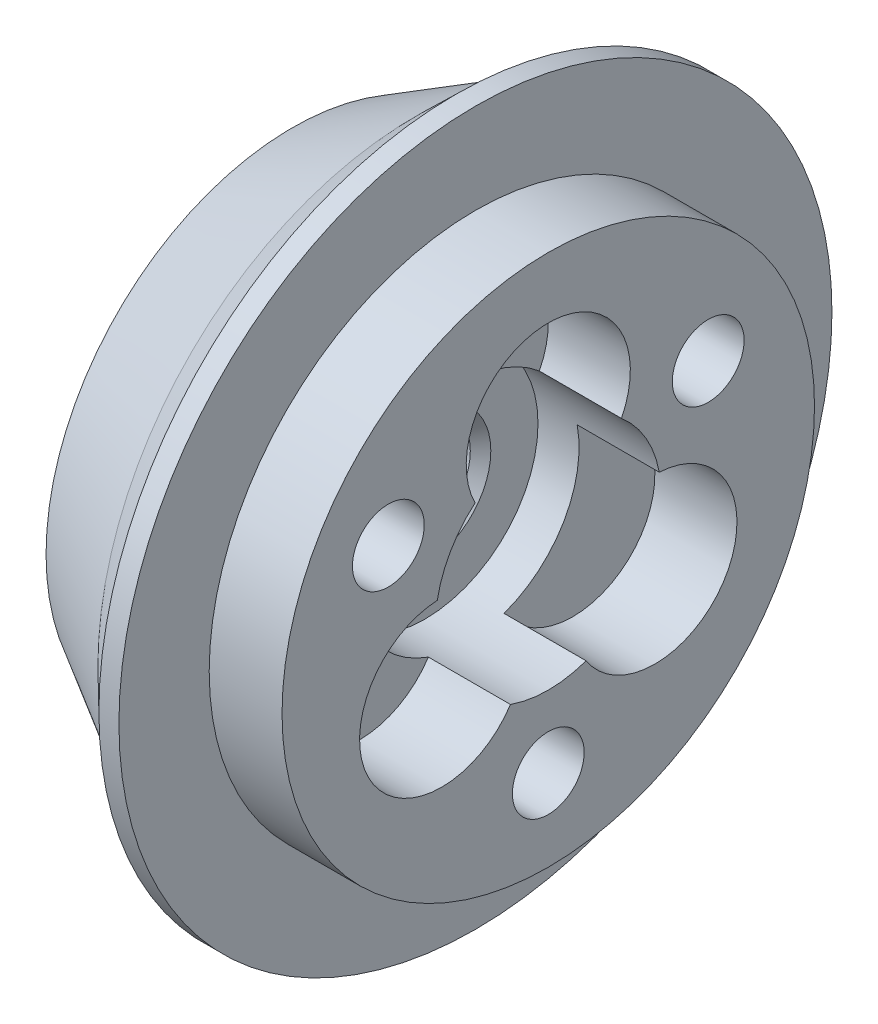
ISO-10303-21;
HEADER;
FILE_DESCRIPTION(('STEP AP214'),'2;1');
FILE_NAME('part.step','',(''),(''),'','','');
FILE_SCHEMA(('AUTOMOTIVE_DESIGN { 1 0 10303 214 1 1 1 1 }'));
ENDSEC;
DATA;
#1=APPLICATION_CONTEXT('core data for automotive mechanical design processes');
#2=APPLICATION_PROTOCOL_DEFINITION('international standard','automotive_design',2000,#1);
#3=PRODUCT_CONTEXT('',#1,'mechanical');
#4=PRODUCT('Part','Part','',(#3));
#5=PRODUCT_RELATED_PRODUCT_CATEGORY('part','',(#4));
#6=PRODUCT_DEFINITION_FORMATION('','',#4);
#7=PRODUCT_DEFINITION_CONTEXT('part definition',#1,'design');
#8=PRODUCT_DEFINITION('design','',#6,#7);
#9=PRODUCT_DEFINITION_SHAPE('','',#8);
#10=(LENGTH_UNIT() NAMED_UNIT(*) SI_UNIT(.MILLI.,.METRE.));
#11=(NAMED_UNIT(*) PLANE_ANGLE_UNIT() SI_UNIT($,.RADIAN.));
#12=(NAMED_UNIT(*) SI_UNIT($,.STERADIAN.) SOLID_ANGLE_UNIT());
#13=UNCERTAINTY_MEASURE_WITH_UNIT(LENGTH_MEASURE(1.E-05),#10,'distance_accuracy_value','');
#14=(GEOMETRIC_REPRESENTATION_CONTEXT(3) GLOBAL_UNCERTAINTY_ASSIGNED_CONTEXT((#13)) GLOBAL_UNIT_ASSIGNED_CONTEXT((#10,
#11,#12)) REPRESENTATION_CONTEXT('',''));
#15=CARTESIAN_POINT('',(0.,0.,0.));
#16=DIRECTION('',(0.,0.,1.));
#17=DIRECTION('',(1.,0.,0.));
#18=AXIS2_PLACEMENT_3D('',#15,#16,#17);
#19=CARTESIAN_POINT('',(5.9511505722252,2.01,0.));
#20=DIRECTION('',(1.,0.,0.));
#21=DIRECTION('',(0.,0.,-1.));
#22=AXIS2_PLACEMENT_3D('',#19,#20,#21);
#23=PLANE('',#22);
#24=CARTESIAN_POINT('',(5.9511505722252,0.,0.));
#25=DIRECTION('',(1.,0.,0.));
#26=DIRECTION('',(0.,0.,-1.));
#27=AXIS2_PLACEMENT_3D('',#24,#25,#26);
#28=CIRCLE('',#27,2.21);
#29=CARTESIAN_POINT('',(5.9511505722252,0.,-2.21));
#30=VERTEX_POINT('',#29);
#31=EDGE_CURVE('E293',#30,#30,#28,.F.);
#32=ORIENTED_EDGE('',*,*,#31,.T.);
#33=EDGE_LOOP('',(#32));
#34=FACE_BOUND('',#33,.T.);
#35=CARTESIAN_POINT('',(5.9511505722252,0.,0.));
#36=DIRECTION('',(1.,0.,0.));
#37=DIRECTION('',(0.,0.,-1.));
#38=AXIS2_PLACEMENT_3D('',#35,#36,#37);
#39=CIRCLE('',#38,4.5);
#40=CARTESIAN_POINT('',(5.9511505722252,3.28178047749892,3.07894736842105));
#41=VERTEX_POINT('',#40);
#42=CARTESIAN_POINT('',(5.9511505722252,-3.28178047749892,3.07894736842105));
#43=VERTEX_POINT('',#42);
#44=EDGE_CURVE('E11',#41,#43,#39,.T.);
#45=ORIENTED_EDGE('',*,*,#44,.T.);
#46=CARTESIAN_POINT('',(5.9511505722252,-6.92820323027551,6.5));
#47=DIRECTION('',(1.,0.,0.));
#48=DIRECTION('',(0.,0.,-1.));
#49=AXIS2_PLACEMENT_3D('',#46,#47,#48);
#50=CIRCLE('',#49,5.);
#51=CARTESIAN_POINT('',(5.9511505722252,-5.07028920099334,1.85800091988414));
#52=VERTEX_POINT('',#51);
#53=EDGE_CURVE('E215',#43,#52,#50,.F.);
#54=ORIENTED_EDGE('',*,*,#53,.T.);
#55=CARTESIAN_POINT('',(5.9511505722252,0.,0.));
#56=DIRECTION('',(-1.,0.,0.));
#57=DIRECTION('',(0.,0.,1.));
#58=AXIS2_PLACEMENT_3D('',#55,#56,#57);
#59=CIRCLE('',#58,5.4);
#60=CARTESIAN_POINT('',(5.9511505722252,-5.07028920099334,-1.85800091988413));
#61=VERTEX_POINT('',#60);
#62=EDGE_CURVE('E272',#61,#52,#59,.T.);
#63=ORIENTED_EDGE('',*,*,#62,.F.);
#64=CARTESIAN_POINT('',(5.9511505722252,-6.92820323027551,-6.5));
#65=DIRECTION('',(1.,0.,0.));
#66=DIRECTION('',(0.,0.,-1.));
#67=AXIS2_PLACEMENT_3D('',#64,#65,#66);
#68=CIRCLE('',#67,5.);
#69=CARTESIAN_POINT('',(5.9511505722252,-3.28178047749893,-3.07894736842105));
#70=VERTEX_POINT('',#69);
#71=EDGE_CURVE('E239',#61,#70,#68,.F.);
#72=ORIENTED_EDGE('',*,*,#71,.T.);
#73=CARTESIAN_POINT('',(5.9511505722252,0.,0.));
#74=DIRECTION('',(1.,0.,0.));
#75=DIRECTION('',(0.,0.,-1.));
#76=AXIS2_PLACEMENT_3D('',#73,#74,#75);
#77=CIRCLE('',#76,4.5);
#78=CARTESIAN_POINT('',(5.9511505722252,3.28178047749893,-3.07894736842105));
#79=VERTEX_POINT('',#78);
#80=EDGE_CURVE('E344',#70,#79,#77,.T.);
#81=ORIENTED_EDGE('',*,*,#80,.T.);
#82=CARTESIAN_POINT('',(5.9511505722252,6.92820323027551,-6.5));
#83=DIRECTION('',(1.,0.,0.));
#84=DIRECTION('',(0.,0.,-1.));
#85=AXIS2_PLACEMENT_3D('',#82,#83,#84);
#86=CIRCLE('',#85,5.);
#87=CARTESIAN_POINT('',(5.9511505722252,5.07028920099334,-1.85800091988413));
#88=VERTEX_POINT('',#87);
#89=EDGE_CURVE('E248',#88,#79,#86,.T.);
#90=ORIENTED_EDGE('',*,*,#89,.F.);
#91=CARTESIAN_POINT('',(5.9511505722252,5.07028920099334,1.85800091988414));
#92=VERTEX_POINT('',#91);
#93=EDGE_CURVE('E271',#92,#88,#59,.T.);
#94=ORIENTED_EDGE('',*,*,#93,.F.);
#95=CARTESIAN_POINT('',(5.9511505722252,6.92820323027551,6.5));
#96=DIRECTION('',(1.,0.,0.));
#97=DIRECTION('',(0.,0.,-1.));
#98=AXIS2_PLACEMENT_3D('',#95,#96,#97);
#99=CIRCLE('',#98,5.);
#100=EDGE_CURVE('E208',#41,#92,#99,.T.);
#101=ORIENTED_EDGE('',*,*,#100,.F.);
#102=EDGE_LOOP('',(#45,#54,#63,#72,#81,#90,#94,#101));
#103=FACE_BOUND('',#102,.T.);
#104=ADVANCED_FACE('F30',(#34,#103),#23,.T.);
#105=CARTESIAN_POINT('',(0.,0.,0.));
#106=DIRECTION('',(-1.,0.,0.));
#107=DIRECTION('',(0.,0.,1.));
#108=AXIS2_PLACEMENT_3D('',#105,#106,#107);
#109=CYLINDRICAL_SURFACE('',#108,5.4);
#110=CARTESIAN_POINT('',(11.9511505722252,0.,0.));
#111=DIRECTION('',(1.,0.,0.));
#112=DIRECTION('',(0.,0.,-1.));
#113=AXIS2_PLACEMENT_3D('',#110,#111,#112);
#114=CIRCLE('',#113,5.4);
#115=CARTESIAN_POINT('',(11.9511505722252,0.,-5.4));
#116=VERTEX_POINT('',#115);
#117=EDGE_CURVE('E308',#116,#116,#114,.T.);
#118=ORIENTED_EDGE('',*,*,#117,.T.);
#119=EDGE_LOOP('',(#118));
#120=FACE_BOUND('',#119,.T.);
#121=ORIENTED_EDGE('',*,*,#62,.T.);
#122=DIRECTION('',(-1.,0.,0.));
#123=VECTOR('',#122,1.);
#124=CARTESIAN_POINT('',(7.9755752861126,-5.07028920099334,1.85800091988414));
#125=LINE('',#124,#123);
#126=CARTESIAN_POINT('',(10.,-5.07028920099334,1.85800091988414));
#127=VERTEX_POINT('',#126);
#128=EDGE_CURVE('E38',#52,#127,#125,.F.);
#129=ORIENTED_EDGE('',*,*,#128,.T.);
#130=CARTESIAN_POINT('',(10.,0.,0.));
#131=DIRECTION('',(-1.,0.,0.));
#132=DIRECTION('',(0.,0.,1.));
#133=AXIS2_PLACEMENT_3D('',#130,#131,#132);
#134=CIRCLE('',#133,5.4);
#135=CARTESIAN_POINT('',(10.,5.07028920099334,1.85800091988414));
#136=VERTEX_POINT('',#135);
#137=EDGE_CURVE('E347',#127,#136,#134,.T.);
#138=ORIENTED_EDGE('',*,*,#137,.T.);
#139=DIRECTION('',(-1.,0.,0.));
#140=VECTOR('',#139,1.);
#141=CARTESIAN_POINT('',(7.9755752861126,5.07028920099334,1.85800091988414));
#142=LINE('',#141,#140);
#143=EDGE_CURVE('E350',#92,#136,#142,.F.);
#144=ORIENTED_EDGE('',*,*,#143,.F.);
#145=ORIENTED_EDGE('',*,*,#93,.T.);
#146=DIRECTION('',(-1.,0.,0.));
#147=VECTOR('',#146,1.);
#148=CARTESIAN_POINT('',(5.,5.07028920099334,-1.85800091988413));
#149=LINE('',#148,#147);
#150=CARTESIAN_POINT('',(10.,5.07028920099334,-1.85800091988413));
#151=VERTEX_POINT('',#150);
#152=EDGE_CURVE('E341',#151,#88,#149,.T.);
#153=ORIENTED_EDGE('',*,*,#152,.F.);
#154=CARTESIAN_POINT('',(10.,0.,0.));
#155=DIRECTION('',(-1.,0.,0.));
#156=DIRECTION('',(0.,0.,1.));
#157=AXIS2_PLACEMENT_3D('',#154,#155,#156);
#158=CIRCLE('',#157,5.4);
#159=CARTESIAN_POINT('',(10.,-5.07028920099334,-1.85800091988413));
#160=VERTEX_POINT('',#159);
#161=EDGE_CURVE('E335',#151,#160,#158,.T.);
#162=ORIENTED_EDGE('',*,*,#161,.T.);
#163=DIRECTION('',(-1.,0.,0.));
#164=VECTOR('',#163,1.);
#165=CARTESIAN_POINT('',(7.9755752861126,-5.07028920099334,-1.85800091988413));
#166=LINE('',#165,#164);
#167=EDGE_CURVE('E338',#160,#61,#166,.T.);
#168=ORIENTED_EDGE('',*,*,#167,.T.);
#169=EDGE_LOOP('',(#121,#129,#138,#144,#145,#153,#162,#168));
#170=FACE_BOUND('',#169,.T.);
#171=ADVANCED_FACE('F353',(#120,#170),#109,.F.);
#172=CARTESIAN_POINT('',(0.,0.,0.));
#173=DIRECTION('',(1.,0.,0.));
#174=DIRECTION('',(0.,0.,-1.));
#175=AXIS2_PLACEMENT_3D('',#172,#173,#174);
#176=PLANE('',#175);
#177=CARTESIAN_POINT('',(0.,6.92820323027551,6.5));
#178=DIRECTION('',(-1.,0.,0.));
#179=DIRECTION('',(0.,0.,1.));
#180=AXIS2_PLACEMENT_3D('',#177,#178,#179);
#181=CIRCLE('',#180,5.);
#182=CARTESIAN_POINT('',(0.,10.5746259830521,9.92105263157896));
#183=VERTEX_POINT('',#182);
#184=CARTESIAN_POINT('',(0.,3.28178047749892,3.07894736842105));
#185=VERTEX_POINT('',#184);
#186=EDGE_CURVE('E198',#183,#185,#181,.T.);
#187=ORIENTED_EDGE('',*,*,#186,.F.);
#188=CARTESIAN_POINT('',(0.,0.,0.));
#189=DIRECTION('',(-1.,0.,0.));
#190=DIRECTION('',(0.,0.,1.));
#191=AXIS2_PLACEMENT_3D('',#188,#189,#190);
#192=CIRCLE('',#191,14.5);
#193=CARTESIAN_POINT('',(0.,-10.5746259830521,9.92105263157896));
#194=VERTEX_POINT('',#193);
#195=EDGE_CURVE('E45',#194,#183,#192,.T.);
#196=ORIENTED_EDGE('',*,*,#195,.F.);
#197=CARTESIAN_POINT('',(0.,-6.92820323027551,6.5));
#198=DIRECTION('',(-1.,0.,0.));
#199=DIRECTION('',(0.,0.,1.));
#200=AXIS2_PLACEMENT_3D('',#197,#198,#199);
#201=CIRCLE('',#200,5.);
#202=CARTESIAN_POINT('',(0.,-3.28178047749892,3.07894736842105));
#203=VERTEX_POINT('',#202);
#204=EDGE_CURVE('E191',#194,#203,#201,.F.);
#205=ORIENTED_EDGE('',*,*,#204,.T.);
#206=CARTESIAN_POINT('',(0.,0.,0.));
#207=DIRECTION('',(-1.,0.,0.));
#208=DIRECTION('',(0.,0.,1.));
#209=AXIS2_PLACEMENT_3D('',#206,#207,#208);
#210=CIRCLE('',#209,4.5);
#211=EDGE_CURVE('E201',#203,#185,#210,.T.);
#212=ORIENTED_EDGE('',*,*,#211,.T.);
#213=EDGE_LOOP('',(#187,#196,#205,#212));
#214=FACE_BOUND('',#213,.T.);
#215=CARTESIAN_POINT('',(0.,0.,0.));
#216=DIRECTION('',(-1.,0.,0.));
#217=DIRECTION('',(0.,0.,1.));
#218=AXIS2_PLACEMENT_3D('',#215,#216,#217);
#219=CIRCLE('',#218,14.5);
#220=CARTESIAN_POINT('',(0.,10.5746259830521,-9.92105263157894));
#221=VERTEX_POINT('',#220);
#222=CARTESIAN_POINT('',(0.,-10.5746259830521,-9.92105263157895));
#223=VERTEX_POINT('',#222);
#224=EDGE_CURVE('E229',#221,#223,#219,.T.);
#225=ORIENTED_EDGE('',*,*,#224,.F.);
#226=CARTESIAN_POINT('',(0.,6.92820323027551,-6.5));
#227=DIRECTION('',(-1.,0.,0.));
#228=DIRECTION('',(0.,0.,1.));
#229=AXIS2_PLACEMENT_3D('',#226,#227,#228);
#230=CIRCLE('',#229,5.);
#231=CARTESIAN_POINT('',(0.,3.28178047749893,-3.07894736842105));
#232=VERTEX_POINT('',#231);
#233=EDGE_CURVE('E218',#232,#221,#230,.T.);
#234=ORIENTED_EDGE('',*,*,#233,.F.);
#235=CARTESIAN_POINT('',(0.,0.,0.));
#236=DIRECTION('',(-1.,0.,0.));
#237=DIRECTION('',(0.,0.,1.));
#238=AXIS2_PLACEMENT_3D('',#235,#236,#237);
#239=CIRCLE('',#238,4.5);
#240=CARTESIAN_POINT('',(0.,-3.28178047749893,-3.07894736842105));
#241=VERTEX_POINT('',#240);
#242=EDGE_CURVE('E222',#232,#241,#239,.T.);
#243=ORIENTED_EDGE('',*,*,#242,.T.);
#244=CARTESIAN_POINT('',(0.,-6.92820323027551,-6.5));
#245=DIRECTION('',(-1.,0.,0.));
#246=DIRECTION('',(0.,0.,1.));
#247=AXIS2_PLACEMENT_3D('',#244,#245,#246);
#248=CIRCLE('',#247,5.);
#249=EDGE_CURVE('E232',#241,#223,#248,.F.);
#250=ORIENTED_EDGE('',*,*,#249,.T.);
#251=EDGE_LOOP('',(#225,#234,#243,#250));
#252=FACE_BOUND('',#251,.T.);
#253=CARTESIAN_POINT('',(0.,0.,0.));
#254=DIRECTION('',(1.,0.,0.));
#255=DIRECTION('',(0.,0.,-1.));
#256=AXIS2_PLACEMENT_3D('',#253,#254,#255);
#257=CIRCLE('',#256,2.21000000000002);
#258=CARTESIAN_POINT('',(0.,0.,-2.21000000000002));
#259=VERTEX_POINT('',#258);
#260=EDGE_CURVE('E302',#259,#259,#257,.T.);
#261=ORIENTED_EDGE('',*,*,#260,.T.);
#262=EDGE_LOOP('',(#261));
#263=FACE_BOUND('',#262,.T.);
#264=CARTESIAN_POINT('',(0.,0.,0.));
#265=DIRECTION('',(-1.,0.,0.));
#266=DIRECTION('',(0.,0.,1.));
#267=AXIS2_PLACEMENT_3D('',#264,#265,#266);
#268=CIRCLE('',#267,24.);
#269=CARTESIAN_POINT('',(0.,0.,24.));
#270=VERTEX_POINT('',#269);
#271=EDGE_CURVE('E290',#270,#270,#268,.T.);
#272=ORIENTED_EDGE('',*,*,#271,.T.);
#273=EDGE_LOOP('',(#272));
#274=FACE_BOUND('',#273,.T.);
#275=ADVANCED_FACE('F371',(#214,#252,#263,#274),#176,.F.);
#276=CARTESIAN_POINT('',(24.9511505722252,25.95,0.));
#277=DIRECTION('',(-1.,0.,0.));
#278=DIRECTION('',(0.,0.,1.));
#279=AXIS2_PLACEMENT_3D('',#276,#277,#278);
#280=PLANE('',#279);
#281=CARTESIAN_POINT('',(24.9511505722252,9.00000000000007,15.5884572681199));
#282=DIRECTION('',(1.,0.,0.));
#283=DIRECTION('',(0.,0.,-1.));
#284=AXIS2_PLACEMENT_3D('',#281,#282,#283);
#285=CIRCLE('',#284,3.5);
#286=CARTESIAN_POINT('',(24.9511505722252,9.00000000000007,12.0884572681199));
#287=VERTEX_POINT('',#286);
#288=EDGE_CURVE('E172',#287,#287,#285,.T.);
#289=ORIENTED_EDGE('',*,*,#288,.F.);
#290=EDGE_LOOP('',(#289));
#291=FACE_BOUND('',#290,.T.);
#292=CARTESIAN_POINT('',(24.9511505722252,9.00000000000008,-15.5884572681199));
#293=DIRECTION('',(1.,0.,0.));
#294=DIRECTION('',(0.,0.,-1.));
#295=AXIS2_PLACEMENT_3D('',#292,#293,#294);
#296=CIRCLE('',#295,3.5);
#297=CARTESIAN_POINT('',(24.9511505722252,9.00000000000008,-19.0884572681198));
#298=VERTEX_POINT('',#297);
#299=EDGE_CURVE('E180',#298,#298,#296,.T.);
#300=ORIENTED_EDGE('',*,*,#299,.F.);
#301=EDGE_LOOP('',(#300));
#302=FACE_BOUND('',#301,.T.);
#303=CARTESIAN_POINT('',(24.9511505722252,-18.,0.));
#304=DIRECTION('',(1.,0.,0.));
#305=DIRECTION('',(0.,0.,-1.));
#306=AXIS2_PLACEMENT_3D('',#303,#304,#305);
#307=CIRCLE('',#306,3.5);
#308=CARTESIAN_POINT('',(24.9511505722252,-18.,-3.5));
#309=VERTEX_POINT('',#308);
#310=EDGE_CURVE('E186',#309,#309,#307,.T.);
#311=ORIENTED_EDGE('',*,*,#310,.F.);
#312=EDGE_LOOP('',(#311));
#313=FACE_BOUND('',#312,.T.);
#314=CARTESIAN_POINT('',(24.9511505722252,0.,0.));
#315=DIRECTION('',(-1.,0.,0.));
#316=DIRECTION('',(0.,0.,1.));
#317=AXIS2_PLACEMENT_3D('',#314,#315,#316);
#318=CIRCLE('',#317,25.95);
#319=CARTESIAN_POINT('',(24.9511505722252,0.,25.95));
#320=VERTEX_POINT('',#319);
#321=EDGE_CURVE('E275',#320,#320,#318,.T.);
#322=ORIENTED_EDGE('',*,*,#321,.F.);
#323=EDGE_LOOP('',(#322));
#324=FACE_BOUND('',#323,.T.);
#325=CARTESIAN_POINT('',(24.9511505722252,0.,0.));
#326=DIRECTION('',(-1.,0.,0.));
#327=DIRECTION('',(0.,0.,1.));
#328=AXIS2_PLACEMENT_3D('',#325,#326,#327);
#329=CIRCLE('',#328,11.);
#330=CARTESIAN_POINT('',(24.9511505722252,-10.3636259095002,-3.68717480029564));
#331=VERTEX_POINT('',#330);
#332=CARTESIAN_POINT('',(24.9511505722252,-10.3636259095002,3.68717480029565));
#333=VERTEX_POINT('',#332);
#334=EDGE_CURVE('E268',#331,#333,#329,.T.);
#335=ORIENTED_EDGE('',*,*,#334,.T.);
#336=CARTESIAN_POINT('',(24.9511505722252,-6.00000000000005,10.3923048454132));
#337=DIRECTION('',(1.,0.,0.));
#338=DIRECTION('',(0.,0.,-1.));
#339=AXIS2_PLACEMENT_3D('',#336,#337,#338);
#340=CIRCLE('',#339,8.);
#341=CARTESIAN_POINT('',(24.9511505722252,1.98862590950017,10.8187507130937));
#342=VERTEX_POINT('',#341);
#343=EDGE_CURVE('E250',#342,#333,#340,.T.);
#344=ORIENTED_EDGE('',*,*,#343,.F.);
#345=CARTESIAN_POINT('',(24.9511505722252,8.375,7.13157591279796));
#346=VERTEX_POINT('',#345);
#347=EDGE_CURVE('E261',#342,#346,#329,.T.);
#348=ORIENTED_EDGE('',*,*,#347,.T.);
#349=CARTESIAN_POINT('',(24.9511505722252,12.,0.));
#350=DIRECTION('',(1.,0.,0.));
#351=DIRECTION('',(0.,0.,-1.));
#352=AXIS2_PLACEMENT_3D('',#349,#350,#351);
#353=CIRCLE('',#352,8.);
#354=CARTESIAN_POINT('',(24.9511505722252,8.375,-7.13157591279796));
#355=VERTEX_POINT('',#354);
#356=EDGE_CURVE('E257',#355,#346,#353,.T.);
#357=ORIENTED_EDGE('',*,*,#356,.F.);
#358=CARTESIAN_POINT('',(24.9511505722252,1.98862590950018,-10.8187507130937));
#359=VERTEX_POINT('',#358);
#360=EDGE_CURVE('E264',#355,#359,#329,.T.);
#361=ORIENTED_EDGE('',*,*,#360,.T.);
#362=CARTESIAN_POINT('',(24.9511505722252,-6.00000000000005,-10.3923048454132));
#363=DIRECTION('',(1.,0.,0.));
#364=DIRECTION('',(0.,0.,-1.));
#365=AXIS2_PLACEMENT_3D('',#362,#363,#364);
#366=CIRCLE('',#365,8.00000000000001);
#367=EDGE_CURVE('E253',#331,#359,#366,.T.);
#368=ORIENTED_EDGE('',*,*,#367,.F.);
#369=EDGE_LOOP('',(#335,#344,#348,#357,#361,#368));
#370=FACE_BOUND('',#369,.T.);
#371=ADVANCED_FACE('F425',(#291,#302,#313,#324,#370),#280,.F.);
#372=CARTESIAN_POINT('',(11.9511505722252,0.,0.));
#373=DIRECTION('',(1.,0.,0.));
#374=DIRECTION('',(0.,0.,-1.));
#375=AXIS2_PLACEMENT_3D('',#372,#373,#374);
#376=CONICAL_SURFACE('',#375,30.9,0.5235987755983);
#377=ORIENTED_EDGE('',*,*,#271,.F.);
#378=EDGE_LOOP('',(#377));
#379=FACE_BOUND('',#378,.T.);
#380=CARTESIAN_POINT('',(11.9511505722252,0.,0.));
#381=DIRECTION('',(-1.,0.,0.));
#382=DIRECTION('',(0.,0.,1.));
#383=AXIS2_PLACEMENT_3D('',#380,#381,#382);
#384=CIRCLE('',#383,30.9);
#385=CARTESIAN_POINT('',(11.9511505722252,0.,30.9));
#386=VERTEX_POINT('',#385);
#387=EDGE_CURVE('E287',#386,#386,#384,.T.);
#388=ORIENTED_EDGE('',*,*,#387,.T.);
#389=EDGE_LOOP('',(#388));
#390=FACE_BOUND('',#389,.T.);
#391=ADVANCED_FACE('F428',(#379,#390),#376,.T.);
#392=CARTESIAN_POINT('',(15.9,0.,0.));
#393=DIRECTION('',(1.,0.,0.));
#394=DIRECTION('',(0.,0.,-1.));
#395=AXIS2_PLACEMENT_3D('',#392,#393,#394);
#396=CONICAL_SURFACE('',#395,34.75,0.772723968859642);
#397=ORIENTED_EDGE('',*,*,#387,.F.);
#398=EDGE_LOOP('',(#397));
#399=FACE_BOUND('',#398,.T.);
#400=CARTESIAN_POINT('',(15.9,0.,0.));
#401=DIRECTION('',(-1.,0.,0.));
#402=DIRECTION('',(0.,0.,1.));
#403=AXIS2_PLACEMENT_3D('',#400,#401,#402);
#404=CIRCLE('',#403,34.75);
#405=CARTESIAN_POINT('',(15.9,0.,34.75));
#406=VERTEX_POINT('',#405);
#407=EDGE_CURVE('E284',#406,#406,#404,.T.);
#408=ORIENTED_EDGE('',*,*,#407,.T.);
#409=EDGE_LOOP('',(#408));
#410=FACE_BOUND('',#409,.T.);
#411=ADVANCED_FACE('F440',(#399,#410),#396,.T.);
#412=CARTESIAN_POINT('',(0.,0.,0.));
#413=DIRECTION('',(-1.,0.,0.));
#414=DIRECTION('',(0.,0.,1.));
#415=AXIS2_PLACEMENT_3D('',#412,#413,#414);
#416=CYLINDRICAL_SURFACE('',#415,34.75);
#417=ORIENTED_EDGE('',*,*,#407,.F.);
#418=EDGE_LOOP('',(#417));
#419=FACE_BOUND('',#418,.T.);
#420=CARTESIAN_POINT('',(17.8511505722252,0.,0.));
#421=DIRECTION('',(-1.,0.,0.));
#422=DIRECTION('',(0.,0.,1.));
#423=AXIS2_PLACEMENT_3D('',#420,#421,#422);
#424=CIRCLE('',#423,34.75);
#425=CARTESIAN_POINT('',(17.8511505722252,0.,34.75));
#426=VERTEX_POINT('',#425);
#427=EDGE_CURVE('E281',#426,#426,#424,.T.);
#428=ORIENTED_EDGE('',*,*,#427,.T.);
#429=EDGE_LOOP('',(#428));
#430=FACE_BOUND('',#429,.T.);
#431=ADVANCED_FACE('F436',(#419,#430),#416,.T.);
#432=CARTESIAN_POINT('',(17.8511505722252,34.75,0.));
#433=DIRECTION('',(-1.,0.,0.));
#434=DIRECTION('',(0.,0.,1.));
#435=AXIS2_PLACEMENT_3D('',#432,#433,#434);
#436=PLANE('',#435);
#437=ORIENTED_EDGE('',*,*,#427,.F.);
#438=EDGE_LOOP('',(#437));
#439=FACE_BOUND('',#438,.T.);
#440=CARTESIAN_POINT('',(17.8511505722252,0.,0.));
#441=DIRECTION('',(-1.,0.,0.));
#442=DIRECTION('',(0.,0.,1.));
#443=AXIS2_PLACEMENT_3D('',#440,#441,#442);
#444=CIRCLE('',#443,25.95);
#445=CARTESIAN_POINT('',(17.8511505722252,0.,25.95));
#446=VERTEX_POINT('',#445);
#447=EDGE_CURVE('E278',#446,#446,#444,.T.);
#448=ORIENTED_EDGE('',*,*,#447,.T.);
#449=EDGE_LOOP('',(#448));
#450=FACE_BOUND('',#449,.T.);
#451=ADVANCED_FACE('F432',(#439,#450),#436,.F.);
#452=CARTESIAN_POINT('',(0.,0.,0.));
#453=DIRECTION('',(-1.,0.,0.));
#454=DIRECTION('',(0.,0.,1.));
#455=AXIS2_PLACEMENT_3D('',#452,#453,#454);
#456=CYLINDRICAL_SURFACE('',#455,25.95);
#457=ORIENTED_EDGE('',*,*,#447,.F.);
#458=EDGE_LOOP('',(#457));
#459=FACE_BOUND('',#458,.T.);
#460=ORIENTED_EDGE('',*,*,#321,.T.);
#461=EDGE_LOOP('',(#460));
#462=FACE_BOUND('',#461,.T.);
#463=ADVANCED_FACE('F423',(#459,#462),#456,.T.);
#464=CARTESIAN_POINT('',(0.,0.,0.));
#465=DIRECTION('',(-1.,0.,0.));
#466=DIRECTION('',(0.,0.,1.));
#467=AXIS2_PLACEMENT_3D('',#464,#465,#466);
#468=CYLINDRICAL_SURFACE('',#467,2.01);
#469=CARTESIAN_POINT('',(5.75115057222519,0.,0.));
#470=DIRECTION('',(1.,0.,0.));
#471=DIRECTION('',(0.,0.,-1.));
#472=AXIS2_PLACEMENT_3D('',#469,#470,#471);
#473=CIRCLE('',#472,2.01);
#474=CARTESIAN_POINT('',(5.75115057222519,0.,-2.01));
#475=VERTEX_POINT('',#474);
#476=EDGE_CURVE('E299',#475,#475,#473,.T.);
#477=ORIENTED_EDGE('',*,*,#476,.T.);
#478=EDGE_LOOP('',(#477));
#479=FACE_BOUND('',#478,.T.);
#480=CARTESIAN_POINT('',(0.200000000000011,0.,0.));
#481=DIRECTION('',(1.,0.,0.));
#482=DIRECTION('',(0.,0.,-1.));
#483=AXIS2_PLACEMENT_3D('',#480,#481,#482);
#484=CIRCLE('',#483,2.01);
#485=CARTESIAN_POINT('',(0.200000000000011,0.,-2.01));
#486=VERTEX_POINT('',#485);
#487=EDGE_CURVE('E296',#486,#486,#484,.F.);
#488=ORIENTED_EDGE('',*,*,#487,.T.);
#489=EDGE_LOOP('',(#488));
#490=FACE_BOUND('',#489,.T.);
#491=ADVANCED_FACE('F419',(#479,#490),#468,.F.);
#492=CARTESIAN_POINT('',(12.9511505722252,5.4,0.));
#493=DIRECTION('',(1.,0.,0.));
#494=DIRECTION('',(0.,0.,-1.));
#495=AXIS2_PLACEMENT_3D('',#492,#493,#494);
#496=PLANE('',#495);
#497=CARTESIAN_POINT('',(12.9511505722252,0.,0.));
#498=DIRECTION('',(1.,0.,0.));
#499=DIRECTION('',(0.,0.,-1.));
#500=AXIS2_PLACEMENT_3D('',#497,#498,#499);
#501=CIRCLE('',#500,6.4);
#502=CARTESIAN_POINT('',(12.9511505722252,0.,-6.4));
#503=VERTEX_POINT('',#502);
#504=EDGE_CURVE('E305',#503,#503,#501,.F.);
#505=ORIENTED_EDGE('',*,*,#504,.T.);
#506=EDGE_LOOP('',(#505));
#507=FACE_BOUND('',#506,.T.);
#508=CARTESIAN_POINT('',(12.9511505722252,0.,0.));
#509=DIRECTION('',(-1.,0.,0.));
#510=DIRECTION('',(0.,0.,1.));
#511=AXIS2_PLACEMENT_3D('',#508,#509,#510);
#512=CIRCLE('',#511,11.);
#513=CARTESIAN_POINT('',(12.9511505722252,0.,11.));
#514=VERTEX_POINT('',#513);
#515=EDGE_CURVE('E267',#514,#514,#512,.T.);
#516=ORIENTED_EDGE('',*,*,#515,.F.);
#517=EDGE_LOOP('',(#516));
#518=FACE_BOUND('',#517,.T.);
#519=ADVANCED_FACE('F422',(#507,#518),#496,.T.);
#520=CARTESIAN_POINT('',(0.,0.,0.));
#521=DIRECTION('',(-1.,0.,0.));
#522=DIRECTION('',(0.,0.,1.));
#523=AXIS2_PLACEMENT_3D('',#520,#521,#522);
#524=CYLINDRICAL_SURFACE('',#523,11.);
#525=DIRECTION('',(1.,0.,0.));
#526=VECTOR('',#525,1.);
#527=CARTESIAN_POINT('',(20.9511505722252,1.98862590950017,10.8187507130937));
#528=LINE('',#527,#526);
#529=CARTESIAN_POINT('',(16.9511505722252,1.98862590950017,10.8187507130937));
#530=VERTEX_POINT('',#529);
#531=EDGE_CURVE('E333',#530,#342,#528,.T.);
#532=ORIENTED_EDGE('',*,*,#531,.F.);
#533=CARTESIAN_POINT('',(16.9511505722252,0.,0.));
#534=DIRECTION('',(1.,0.,0.));
#535=DIRECTION('',(0.,0.,-1.));
#536=AXIS2_PLACEMENT_3D('',#533,#534,#535);
#537=CIRCLE('',#536,11.);
#538=CARTESIAN_POINT('',(16.9511505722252,-10.3636259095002,3.68717480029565));
#539=VERTEX_POINT('',#538);
#540=EDGE_CURVE('E327',#530,#539,#537,.T.);
#541=ORIENTED_EDGE('',*,*,#540,.T.);
#542=DIRECTION('',(1.,0.,0.));
#543=VECTOR('',#542,1.);
#544=CARTESIAN_POINT('',(20.9511505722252,-10.3636259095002,3.68717480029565));
#545=LINE('',#544,#543);
#546=EDGE_CURVE('E330',#333,#539,#545,.F.);
#547=ORIENTED_EDGE('',*,*,#546,.F.);
#548=ORIENTED_EDGE('',*,*,#334,.F.);
#549=DIRECTION('',(1.,0.,0.));
#550=VECTOR('',#549,1.);
#551=CARTESIAN_POINT('',(20.9511505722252,-10.3636259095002,-3.68717480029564));
#552=LINE('',#551,#550);
#553=CARTESIAN_POINT('',(16.9511505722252,-10.3636259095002,-3.68717480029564));
#554=VERTEX_POINT('',#553);
#555=EDGE_CURVE('E325',#554,#331,#552,.T.);
#556=ORIENTED_EDGE('',*,*,#555,.F.);
#557=CARTESIAN_POINT('',(16.9511505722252,0.,0.));
#558=DIRECTION('',(1.,0.,0.));
#559=DIRECTION('',(0.,0.,-1.));
#560=AXIS2_PLACEMENT_3D('',#557,#558,#559);
#561=CIRCLE('',#560,11.);
#562=CARTESIAN_POINT('',(16.9511505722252,1.98862590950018,-10.8187507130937));
#563=VERTEX_POINT('',#562);
#564=EDGE_CURVE('E319',#554,#563,#561,.T.);
#565=ORIENTED_EDGE('',*,*,#564,.T.);
#566=DIRECTION('',(1.,0.,0.));
#567=VECTOR('',#566,1.);
#568=CARTESIAN_POINT('',(20.9511505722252,1.98862590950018,-10.8187507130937));
#569=LINE('',#568,#567);
#570=EDGE_CURVE('E322',#359,#563,#569,.F.);
#571=ORIENTED_EDGE('',*,*,#570,.F.);
#572=ORIENTED_EDGE('',*,*,#360,.F.);
#573=DIRECTION('',(1.,0.,0.));
#574=VECTOR('',#573,1.);
#575=CARTESIAN_POINT('',(20.9511505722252,8.375,-7.13157591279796));
#576=LINE('',#575,#574);
#577=CARTESIAN_POINT('',(16.9511505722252,8.375,-7.13157591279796));
#578=VERTEX_POINT('',#577);
#579=EDGE_CURVE('E317',#578,#355,#576,.T.);
#580=ORIENTED_EDGE('',*,*,#579,.F.);
#581=CARTESIAN_POINT('',(16.9511505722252,0.,0.));
#582=DIRECTION('',(1.,0.,0.));
#583=DIRECTION('',(0.,0.,-1.));
#584=AXIS2_PLACEMENT_3D('',#581,#582,#583);
#585=CIRCLE('',#584,11.);
#586=CARTESIAN_POINT('',(16.9511505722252,8.375,7.13157591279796));
#587=VERTEX_POINT('',#586);
#588=EDGE_CURVE('E311',#578,#587,#585,.T.);
#589=ORIENTED_EDGE('',*,*,#588,.T.);
#590=DIRECTION('',(1.,0.,0.));
#591=VECTOR('',#590,1.);
#592=CARTESIAN_POINT('',(20.9511505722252,8.375,7.13157591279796));
#593=LINE('',#592,#591);
#594=EDGE_CURVE('E314',#346,#587,#593,.F.);
#595=ORIENTED_EDGE('',*,*,#594,.F.);
#596=ORIENTED_EDGE('',*,*,#347,.F.);
#597=EDGE_LOOP('',(#532,#541,#547,#548,#556,#565,#571,#572,#580,#589,#595,#596));
#598=FACE_BOUND('',#597,.T.);
#599=ORIENTED_EDGE('',*,*,#515,.T.);
#600=EDGE_LOOP('',(#599));
#601=FACE_BOUND('',#600,.T.);
#602=ADVANCED_FACE('F453',(#598,#601),#524,.F.);
#603=CARTESIAN_POINT('',(5.9511505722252,0.,0.));
#604=DIRECTION('',(1.,0.,0.));
#605=DIRECTION('',(0.,0.,-1.));
#606=AXIS2_PLACEMENT_3D('',#603,#604,#605);
#607=CONICAL_SURFACE('',#606,2.21,0.78539816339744);
#608=ORIENTED_EDGE('',*,*,#476,.F.);
#609=EDGE_LOOP('',(#608));
#610=FACE_BOUND('',#609,.T.);
#611=ORIENTED_EDGE('',*,*,#31,.F.);
#612=EDGE_LOOP('',(#611));
#613=FACE_BOUND('',#612,.T.);
#614=ADVANCED_FACE('F450',(#610,#613),#607,.F.);
#615=CARTESIAN_POINT('',(0.200000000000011,0.,0.));
#616=DIRECTION('',(-1.,0.,0.));
#617=DIRECTION('',(0.,0.,1.));
#618=AXIS2_PLACEMENT_3D('',#615,#616,#617);
#619=CONICAL_SURFACE('',#618,2.01,0.785398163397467);
#620=ORIENTED_EDGE('',*,*,#260,.F.);
#621=EDGE_LOOP('',(#620));
#622=FACE_BOUND('',#621,.T.);
#623=ORIENTED_EDGE('',*,*,#487,.F.);
#624=EDGE_LOOP('',(#623));
#625=FACE_BOUND('',#624,.T.);
#626=ADVANCED_FACE('F452',(#622,#625),#619,.F.);
#627=CARTESIAN_POINT('',(12.9511505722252,0.,0.));
#628=DIRECTION('',(1.,0.,0.));
#629=DIRECTION('',(0.,0.,-1.));
#630=AXIS2_PLACEMENT_3D('',#627,#628,#629);
#631=CONICAL_SURFACE('',#630,6.4,0.78539816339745);
#632=ORIENTED_EDGE('',*,*,#117,.F.);
#633=EDGE_LOOP('',(#632));
#634=FACE_BOUND('',#633,.T.);
#635=ORIENTED_EDGE('',*,*,#504,.F.);
#636=EDGE_LOOP('',(#635));
#637=FACE_BOUND('',#636,.T.);
#638=ADVANCED_FACE('F32',(#634,#637),#631,.F.);
#639=CARTESIAN_POINT('',(16.9511505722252,12.,0.));
#640=DIRECTION('',(1.,0.,0.));
#641=DIRECTION('',(0.,0.,-1.));
#642=AXIS2_PLACEMENT_3D('',#639,#640,#641);
#643=CYLINDRICAL_SURFACE('',#642,8.);
#644=ORIENTED_EDGE('',*,*,#579,.T.);
#645=ORIENTED_EDGE('',*,*,#356,.T.);
#646=ORIENTED_EDGE('',*,*,#594,.T.);
#647=CARTESIAN_POINT('',(16.9511505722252,12.,0.));
#648=DIRECTION('',(1.,0.,0.));
#649=DIRECTION('',(0.,0.,-1.));
#650=AXIS2_PLACEMENT_3D('',#647,#648,#649);
#651=CIRCLE('',#650,8.);
#652=EDGE_CURVE('E259',#578,#587,#651,.T.);
#653=ORIENTED_EDGE('',*,*,#652,.F.);
#654=EDGE_LOOP('',(#644,#645,#646,#653));
#655=FACE_BOUND('',#654,.T.);
#656=ADVANCED_FACE('F460',(#655),#643,.F.);
#657=CARTESIAN_POINT('',(16.9511505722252,12.,0.));
#658=DIRECTION('',(1.,0.,0.));
#659=DIRECTION('',(0.,0.,-1.));
#660=AXIS2_PLACEMENT_3D('',#657,#658,#659);
#661=PLANE('',#660);
#662=ORIENTED_EDGE('',*,*,#652,.T.);
#663=ORIENTED_EDGE('',*,*,#588,.F.);
#664=EDGE_LOOP('',(#662,#663));
#665=FACE_BOUND('',#664,.T.);
#666=ADVANCED_FACE('F497',(#665),#661,.T.);
#667=CARTESIAN_POINT('',(16.9511505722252,-6.00000000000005,-10.3923048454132));
#668=DIRECTION('',(1.,0.,0.));
#669=DIRECTION('',(0.,0.,-1.));
#670=AXIS2_PLACEMENT_3D('',#667,#668,#669);
#671=CYLINDRICAL_SURFACE('',#670,8.00000000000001);
#672=ORIENTED_EDGE('',*,*,#555,.T.);
#673=ORIENTED_EDGE('',*,*,#367,.T.);
#674=ORIENTED_EDGE('',*,*,#570,.T.);
#675=CARTESIAN_POINT('',(16.9511505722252,-6.00000000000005,-10.3923048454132));
#676=DIRECTION('',(1.,0.,0.));
#677=DIRECTION('',(0.,0.,-1.));
#678=AXIS2_PLACEMENT_3D('',#675,#676,#677);
#679=CIRCLE('',#678,8.00000000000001);
#680=EDGE_CURVE('E255',#554,#563,#679,.T.);
#681=ORIENTED_EDGE('',*,*,#680,.F.);
#682=EDGE_LOOP('',(#672,#673,#674,#681));
#683=FACE_BOUND('',#682,.T.);
#684=ADVANCED_FACE('F499',(#683),#671,.F.);
#685=CARTESIAN_POINT('',(16.9511505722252,-6.00000000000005,-10.3923048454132));
#686=DIRECTION('',(1.,0.,0.));
#687=DIRECTION('',(0.,0.,-1.));
#688=AXIS2_PLACEMENT_3D('',#685,#686,#687);
#689=PLANE('',#688);
#690=ORIENTED_EDGE('',*,*,#680,.T.);
#691=ORIENTED_EDGE('',*,*,#564,.F.);
#692=EDGE_LOOP('',(#690,#691));
#693=FACE_BOUND('',#692,.T.);
#694=ADVANCED_FACE('F505',(#693),#689,.T.);
#695=CARTESIAN_POINT('',(16.9511505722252,-6.00000000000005,10.3923048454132));
#696=DIRECTION('',(1.,0.,0.));
#697=DIRECTION('',(0.,0.,-1.));
#698=AXIS2_PLACEMENT_3D('',#695,#696,#697);
#699=CYLINDRICAL_SURFACE('',#698,8.);
#700=ORIENTED_EDGE('',*,*,#531,.T.);
#701=ORIENTED_EDGE('',*,*,#343,.T.);
#702=ORIENTED_EDGE('',*,*,#546,.T.);
#703=CARTESIAN_POINT('',(16.9511505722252,-6.00000000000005,10.3923048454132));
#704=DIRECTION('',(1.,0.,0.));
#705=DIRECTION('',(0.,0.,-1.));
#706=AXIS2_PLACEMENT_3D('',#703,#704,#705);
#707=CIRCLE('',#706,8.);
#708=EDGE_CURVE('E251',#530,#539,#707,.T.);
#709=ORIENTED_EDGE('',*,*,#708,.F.);
#710=EDGE_LOOP('',(#700,#701,#702,#709));
#711=FACE_BOUND('',#710,.T.);
#712=ADVANCED_FACE('F566',(#711),#699,.F.);
#713=CARTESIAN_POINT('',(16.9511505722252,-6.00000000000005,10.3923048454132));
#714=DIRECTION('',(1.,0.,0.));
#715=DIRECTION('',(0.,0.,-1.));
#716=AXIS2_PLACEMENT_3D('',#713,#714,#715);
#717=PLANE('',#716);
#718=ORIENTED_EDGE('',*,*,#708,.T.);
#719=ORIENTED_EDGE('',*,*,#540,.F.);
#720=EDGE_LOOP('',(#718,#719));
#721=FACE_BOUND('',#720,.T.);
#722=ADVANCED_FACE('F574',(#721),#717,.T.);
#723=CARTESIAN_POINT('',(10.,6.92820323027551,-6.5));
#724=DIRECTION('',(-1.,0.,0.));
#725=DIRECTION('',(0.,0.,1.));
#726=AXIS2_PLACEMENT_3D('',#723,#724,#725);
#727=CYLINDRICAL_SURFACE('',#726,5.);
#728=ORIENTED_EDGE('',*,*,#89,.T.);
#729=DIRECTION('',(-1.,0.,0.));
#730=VECTOR('',#729,1.);
#731=CARTESIAN_POINT('',(10.,3.28178047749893,-3.07894736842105));
#732=LINE('',#731,#730);
#733=EDGE_CURVE('E237',#79,#232,#732,.T.);
#734=ORIENTED_EDGE('',*,*,#733,.T.);
#735=ORIENTED_EDGE('',*,*,#233,.T.);
#736=DIRECTION('',(-1.,0.,0.));
#737=VECTOR('',#736,1.);
#738=CARTESIAN_POINT('',(10.,10.5746259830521,-9.92105263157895));
#739=LINE('',#738,#737);
#740=CARTESIAN_POINT('',(10.,10.5746259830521,-9.92105263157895));
#741=VERTEX_POINT('',#740);
#742=EDGE_CURVE('E227',#741,#221,#739,.T.);
#743=ORIENTED_EDGE('',*,*,#742,.F.);
#744=CARTESIAN_POINT('',(10.,6.92820323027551,-6.5));
#745=DIRECTION('',(-1.,0.,0.));
#746=DIRECTION('',(0.,0.,1.));
#747=AXIS2_PLACEMENT_3D('',#744,#745,#746);
#748=CIRCLE('',#747,5.);
#749=EDGE_CURVE('E219',#151,#741,#748,.T.);
#750=ORIENTED_EDGE('',*,*,#749,.F.);
#751=ORIENTED_EDGE('',*,*,#152,.T.);
#752=EDGE_LOOP('',(#728,#734,#735,#743,#750,#751));
#753=FACE_BOUND('',#752,.T.);
#754=ADVANCED_FACE('F381',(#753),#727,.F.);
#755=CARTESIAN_POINT('',(10.,0.,0.));
#756=DIRECTION('',(-1.,0.,0.));
#757=DIRECTION('',(0.,0.,1.));
#758=AXIS2_PLACEMENT_3D('',#755,#756,#757);
#759=CYLINDRICAL_SURFACE('',#758,4.5);
#760=DIRECTION('',(-1.,0.,0.));
#761=VECTOR('',#760,1.);
#762=CARTESIAN_POINT('',(10.,-3.28178047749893,-3.07894736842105));
#763=LINE('',#762,#761);
#764=EDGE_CURVE('E240',#70,#241,#763,.T.);
#765=ORIENTED_EDGE('',*,*,#764,.T.);
#766=ORIENTED_EDGE('',*,*,#242,.F.);
#767=ORIENTED_EDGE('',*,*,#733,.F.);
#768=ORIENTED_EDGE('',*,*,#80,.F.);
#769=EDGE_LOOP('',(#765,#766,#767,#768));
#770=FACE_BOUND('',#769,.T.);
#771=ADVANCED_FACE('F385',(#770),#759,.T.);
#772=CARTESIAN_POINT('',(10.,-6.92820323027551,-6.5));
#773=DIRECTION('',(-1.,0.,0.));
#774=DIRECTION('',(0.,0.,1.));
#775=AXIS2_PLACEMENT_3D('',#772,#773,#774);
#776=CYLINDRICAL_SURFACE('',#775,5.);
#777=ORIENTED_EDGE('',*,*,#167,.F.);
#778=CARTESIAN_POINT('',(10.,-6.92820323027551,-6.5));
#779=DIRECTION('',(-1.,0.,0.));
#780=DIRECTION('',(0.,0.,1.));
#781=AXIS2_PLACEMENT_3D('',#778,#779,#780);
#782=CIRCLE('',#781,5.);
#783=CARTESIAN_POINT('',(10.,-10.5746259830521,-9.92105263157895));
#784=VERTEX_POINT('',#783);
#785=EDGE_CURVE('E225',#160,#784,#782,.F.);
#786=ORIENTED_EDGE('',*,*,#785,.T.);
#787=DIRECTION('',(-1.,0.,0.));
#788=VECTOR('',#787,1.);
#789=CARTESIAN_POINT('',(10.,-10.5746259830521,-9.92105263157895));
#790=LINE('',#789,#788);
#791=EDGE_CURVE('E242',#784,#223,#790,.T.);
#792=ORIENTED_EDGE('',*,*,#791,.T.);
#793=ORIENTED_EDGE('',*,*,#249,.F.);
#794=ORIENTED_EDGE('',*,*,#764,.F.);
#795=ORIENTED_EDGE('',*,*,#71,.F.);
#796=EDGE_LOOP('',(#777,#786,#792,#793,#794,#795));
#797=FACE_BOUND('',#796,.T.);
#798=ADVANCED_FACE('F400',(#797),#776,.F.);
#799=CARTESIAN_POINT('',(10.,0.,0.));
#800=DIRECTION('',(-1.,0.,0.));
#801=DIRECTION('',(0.,0.,1.));
#802=AXIS2_PLACEMENT_3D('',#799,#800,#801);
#803=CYLINDRICAL_SURFACE('',#802,14.5);
#804=ORIENTED_EDGE('',*,*,#224,.T.);
#805=ORIENTED_EDGE('',*,*,#791,.F.);
#806=CARTESIAN_POINT('',(10.,0.,0.));
#807=DIRECTION('',(-1.,0.,0.));
#808=DIRECTION('',(0.,0.,1.));
#809=AXIS2_PLACEMENT_3D('',#806,#807,#808);
#810=CIRCLE('',#809,14.5);
#811=EDGE_CURVE('E221',#741,#784,#810,.T.);
#812=ORIENTED_EDGE('',*,*,#811,.F.);
#813=ORIENTED_EDGE('',*,*,#742,.T.);
#814=EDGE_LOOP('',(#804,#805,#812,#813));
#815=FACE_BOUND('',#814,.T.);
#816=ADVANCED_FACE('F394',(#815),#803,.F.);
#817=CARTESIAN_POINT('',(10.,-52.9414213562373,0.));
#818=DIRECTION('',(-1.,0.,0.));
#819=DIRECTION('',(0.,0.,1.));
#820=AXIS2_PLACEMENT_3D('',#817,#818,#819);
#821=PLANE('',#820);
#822=ORIENTED_EDGE('',*,*,#749,.T.);
#823=ORIENTED_EDGE('',*,*,#811,.T.);
#824=ORIENTED_EDGE('',*,*,#785,.F.);
#825=ORIENTED_EDGE('',*,*,#161,.F.);
#826=EDGE_LOOP('',(#822,#823,#824,#825));
#827=FACE_BOUND('',#826,.T.);
#828=ADVANCED_FACE('F397',(#827),#821,.T.);
#829=CARTESIAN_POINT('',(10.,0.,0.));
#830=DIRECTION('',(-1.,0.,0.));
#831=DIRECTION('',(0.,0.,1.));
#832=AXIS2_PLACEMENT_3D('',#829,#830,#831);
#833=CYLINDRICAL_SURFACE('',#832,14.5);
#834=ORIENTED_EDGE('',*,*,#195,.T.);
#835=DIRECTION('',(-1.,0.,0.));
#836=VECTOR('',#835,1.);
#837=CARTESIAN_POINT('',(10.,10.5746259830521,9.92105263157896));
#838=LINE('',#837,#836);
#839=CARTESIAN_POINT('',(10.,10.5746259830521,9.92105263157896));
#840=VERTEX_POINT('',#839);
#841=EDGE_CURVE('E196',#840,#183,#838,.T.);
#842=ORIENTED_EDGE('',*,*,#841,.F.);
#843=CARTESIAN_POINT('',(10.,0.,0.));
#844=DIRECTION('',(-1.,0.,0.));
#845=DIRECTION('',(0.,0.,1.));
#846=AXIS2_PLACEMENT_3D('',#843,#844,#845);
#847=CIRCLE('',#846,14.5);
#848=CARTESIAN_POINT('',(10.,-10.5746259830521,9.92105263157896));
#849=VERTEX_POINT('',#848);
#850=EDGE_CURVE('E189',#849,#840,#847,.T.);
#851=ORIENTED_EDGE('',*,*,#850,.F.);
#852=DIRECTION('',(-1.,0.,0.));
#853=VECTOR('',#852,1.);
#854=CARTESIAN_POINT('',(10.,-10.5746259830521,9.92105263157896));
#855=LINE('',#854,#853);
#856=EDGE_CURVE('E206',#849,#194,#855,.T.);
#857=ORIENTED_EDGE('',*,*,#856,.T.);
#858=EDGE_LOOP('',(#834,#842,#851,#857));
#859=FACE_BOUND('',#858,.T.);
#860=ADVANCED_FACE('F376',(#859),#833,.F.);
#861=CARTESIAN_POINT('',(10.,-6.92820323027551,6.5));
#862=DIRECTION('',(-1.,0.,0.));
#863=DIRECTION('',(0.,0.,1.));
#864=AXIS2_PLACEMENT_3D('',#861,#862,#863);
#865=CYLINDRICAL_SURFACE('',#864,5.);
#866=DIRECTION('',(-1.,0.,0.));
#867=VECTOR('',#866,1.);
#868=CARTESIAN_POINT('',(10.,-3.28178047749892,3.07894736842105));
#869=LINE('',#868,#867);
#870=EDGE_CURVE('E209',#43,#203,#869,.T.);
#871=ORIENTED_EDGE('',*,*,#870,.T.);
#872=ORIENTED_EDGE('',*,*,#204,.F.);
#873=ORIENTED_EDGE('',*,*,#856,.F.);
#874=CARTESIAN_POINT('',(10.,-6.92820323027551,6.5));
#875=DIRECTION('',(-1.,0.,0.));
#876=DIRECTION('',(0.,0.,1.));
#877=AXIS2_PLACEMENT_3D('',#874,#875,#876);
#878=CIRCLE('',#877,5.);
#879=EDGE_CURVE('E193',#849,#127,#878,.F.);
#880=ORIENTED_EDGE('',*,*,#879,.T.);
#881=ORIENTED_EDGE('',*,*,#128,.F.);
#882=ORIENTED_EDGE('',*,*,#53,.F.);
#883=EDGE_LOOP('',(#871,#872,#873,#880,#881,#882));
#884=FACE_BOUND('',#883,.T.);
#885=ADVANCED_FACE('F357',(#884),#865,.F.);
#886=CARTESIAN_POINT('',(10.,0.,0.));
#887=DIRECTION('',(-1.,0.,0.));
#888=DIRECTION('',(0.,0.,1.));
#889=AXIS2_PLACEMENT_3D('',#886,#887,#888);
#890=CYLINDRICAL_SURFACE('',#889,4.5);
#891=DIRECTION('',(-1.,0.,0.));
#892=VECTOR('',#891,1.);
#893=CARTESIAN_POINT('',(10.,3.28178047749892,3.07894736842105));
#894=LINE('',#893,#892);
#895=EDGE_CURVE('E211',#41,#185,#894,.T.);
#896=ORIENTED_EDGE('',*,*,#895,.T.);
#897=ORIENTED_EDGE('',*,*,#211,.F.);
#898=ORIENTED_EDGE('',*,*,#870,.F.);
#899=ORIENTED_EDGE('',*,*,#44,.F.);
#900=EDGE_LOOP('',(#896,#897,#898,#899));
#901=FACE_BOUND('',#900,.T.);
#902=ADVANCED_FACE('F365',(#901),#890,.T.);
#903=CARTESIAN_POINT('',(10.,6.92820323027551,6.5));
#904=DIRECTION('',(-1.,0.,0.));
#905=DIRECTION('',(0.,0.,1.));
#906=AXIS2_PLACEMENT_3D('',#903,#904,#905);
#907=CYLINDRICAL_SURFACE('',#906,5.);
#908=ORIENTED_EDGE('',*,*,#100,.T.);
#909=ORIENTED_EDGE('',*,*,#143,.T.);
#910=CARTESIAN_POINT('',(10.,6.92820323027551,6.5));
#911=DIRECTION('',(-1.,0.,0.));
#912=DIRECTION('',(0.,0.,1.));
#913=AXIS2_PLACEMENT_3D('',#910,#911,#912);
#914=CIRCLE('',#913,5.);
#915=EDGE_CURVE('E53',#840,#136,#914,.T.);
#916=ORIENTED_EDGE('',*,*,#915,.F.);
#917=ORIENTED_EDGE('',*,*,#841,.T.);
#918=ORIENTED_EDGE('',*,*,#186,.T.);
#919=ORIENTED_EDGE('',*,*,#895,.F.);
#920=EDGE_LOOP('',(#908,#909,#916,#917,#918,#919));
#921=FACE_BOUND('',#920,.T.);
#922=ADVANCED_FACE('F368',(#921),#907,.F.);
#923=CARTESIAN_POINT('',(10.,-52.9414213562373,0.));
#924=DIRECTION('',(-1.,0.,0.));
#925=DIRECTION('',(0.,0.,1.));
#926=AXIS2_PLACEMENT_3D('',#923,#924,#925);
#927=PLANE('',#926);
#928=ORIENTED_EDGE('',*,*,#879,.F.);
#929=ORIENTED_EDGE('',*,*,#850,.T.);
#930=ORIENTED_EDGE('',*,*,#915,.T.);
#931=ORIENTED_EDGE('',*,*,#137,.F.);
#932=EDGE_LOOP('',(#928,#929,#930,#931));
#933=FACE_BOUND('',#932,.T.);
#934=ADVANCED_FACE('F375',(#933),#927,.T.);
#935=CARTESIAN_POINT('',(24.9511505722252,-18.,0.));
#936=DIRECTION('',(1.,0.,0.));
#937=DIRECTION('',(0.,0.,-1.));
#938=AXIS2_PLACEMENT_3D('',#935,#936,#937);
#939=CYLINDRICAL_SURFACE('',#938,3.5);
#940=CARTESIAN_POINT('',(11.9511505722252,-18.,0.));
#941=DIRECTION('',(1.,0.,0.));
#942=DIRECTION('',(0.,0.,-1.));
#943=AXIS2_PLACEMENT_3D('',#940,#941,#942);
#944=CIRCLE('',#943,3.5);
#945=CARTESIAN_POINT('',(11.9511505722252,-18.,-3.5));
#946=VERTEX_POINT('',#945);
#947=EDGE_CURVE('E183',#946,#946,#944,.T.);
#948=ORIENTED_EDGE('',*,*,#947,.F.);
#949=EDGE_LOOP('',(#948));
#950=FACE_BOUND('',#949,.T.);
#951=ORIENTED_EDGE('',*,*,#310,.T.);
#952=EDGE_LOOP('',(#951));
#953=FACE_BOUND('',#952,.T.);
#954=ADVANCED_FACE('F663',(#950,#953),#939,.F.);
#955=CARTESIAN_POINT('',(11.9511505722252,-18.,0.));
#956=DIRECTION('',(1.,0.,0.));
#957=DIRECTION('',(0.,0.,-1.));
#958=AXIS2_PLACEMENT_3D('',#955,#956,#957);
#959=CONICAL_SURFACE('',#958,3.5,1.02974425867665);
#960=CARTESIAN_POINT('',(9.84813840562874,-18.,0.));
#961=VERTEX_POINT('',#960);
#962=VERTEX_LOOP('',#961);
#963=FACE_BOUND('',#962,.T.);
#964=ORIENTED_EDGE('',*,*,#947,.T.);
#965=EDGE_LOOP('',(#964));
#966=FACE_BOUND('',#965,.T.);
#967=ADVANCED_FACE('F678',(#963,#966),#959,.F.);
#968=CARTESIAN_POINT('',(24.9511505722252,9.00000000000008,-15.5884572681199));
#969=DIRECTION('',(1.,0.,0.));
#970=DIRECTION('',(0.,0.,-1.));
#971=AXIS2_PLACEMENT_3D('',#968,#969,#970);
#972=CYLINDRICAL_SURFACE('',#971,3.5);
#973=CARTESIAN_POINT('',(11.9511505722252,9.00000000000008,-15.5884572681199));
#974=DIRECTION('',(1.,0.,0.));
#975=DIRECTION('',(0.,0.,-1.));
#976=AXIS2_PLACEMENT_3D('',#973,#974,#975);
#977=CIRCLE('',#976,3.5);
#978=CARTESIAN_POINT('',(11.9511505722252,9.00000000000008,-19.0884572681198));
#979=VERTEX_POINT('',#978);
#980=EDGE_CURVE('E175',#979,#979,#977,.T.);
#981=ORIENTED_EDGE('',*,*,#980,.F.);
#982=EDGE_LOOP('',(#981));
#983=FACE_BOUND('',#982,.T.);
#984=ORIENTED_EDGE('',*,*,#299,.T.);
#985=EDGE_LOOP('',(#984));
#986=FACE_BOUND('',#985,.T.);
#987=ADVANCED_FACE('F687',(#983,#986),#972,.F.);
#988=CARTESIAN_POINT('',(11.9511505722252,9.00000000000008,-15.5884572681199));
#989=DIRECTION('',(1.,0.,0.));
#990=DIRECTION('',(0.,0.,-1.));
#991=AXIS2_PLACEMENT_3D('',#988,#989,#990);
#992=CONICAL_SURFACE('',#991,3.5,1.02974425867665);
#993=CARTESIAN_POINT('',(9.84813840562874,9.00000000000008,-15.5884572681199));
#994=VERTEX_POINT('',#993);
#995=VERTEX_LOOP('',#994);
#996=FACE_BOUND('',#995,.T.);
#997=ORIENTED_EDGE('',*,*,#980,.T.);
#998=EDGE_LOOP('',(#997));
#999=FACE_BOUND('',#998,.T.);
#1000=ADVANCED_FACE('F696',(#996,#999),#992,.F.);
#1001=CARTESIAN_POINT('',(24.9511505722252,9.00000000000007,15.5884572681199));
#1002=DIRECTION('',(1.,0.,0.));
#1003=DIRECTION('',(0.,0.,-1.));
#1004=AXIS2_PLACEMENT_3D('',#1001,#1002,#1003);
#1005=CYLINDRICAL_SURFACE('',#1004,3.5);
#1006=CARTESIAN_POINT('',(11.9511505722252,9.00000000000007,15.5884572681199));
#1007=DIRECTION('',(1.,0.,0.));
#1008=DIRECTION('',(0.,0.,-1.));
#1009=AXIS2_PLACEMENT_3D('',#1006,#1007,#1008);
#1010=CIRCLE('',#1009,3.5);
#1011=CARTESIAN_POINT('',(11.9511505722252,9.00000000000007,12.0884572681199));
#1012=VERTEX_POINT('',#1011);
#1013=EDGE_CURVE('E170',#1012,#1012,#1010,.T.);
#1014=ORIENTED_EDGE('',*,*,#1013,.F.);
#1015=EDGE_LOOP('',(#1014));
#1016=FACE_BOUND('',#1015,.T.);
#1017=ORIENTED_EDGE('',*,*,#288,.T.);
#1018=EDGE_LOOP('',(#1017));
#1019=FACE_BOUND('',#1018,.T.);
#1020=ADVANCED_FACE('F166',(#1016,#1019),#1005,.F.);
#1021=CARTESIAN_POINT('',(11.9511505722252,9.00000000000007,15.5884572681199));
#1022=DIRECTION('',(1.,0.,0.));
#1023=DIRECTION('',(0.,0.,-1.));
#1024=AXIS2_PLACEMENT_3D('',#1021,#1022,#1023);
#1025=CONICAL_SURFACE('',#1024,3.5,1.02974425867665);
#1026=CARTESIAN_POINT('',(9.84813840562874,9.00000000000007,15.5884572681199));
#1027=VERTEX_POINT('',#1026);
#1028=VERTEX_LOOP('',#1027);
#1029=FACE_BOUND('',#1028,.T.);
#1030=ORIENTED_EDGE('',*,*,#1013,.T.);
#1031=EDGE_LOOP('',(#1030));
#1032=FACE_BOUND('',#1031,.T.);
#1033=ADVANCED_FACE('F163',(#1029,#1032),#1025,.F.);
#1034=CLOSED_SHELL('',(#104,#171,#275,#371,#391,#411,#431,#451,#463,#491,#519,#602,#614,#626,
#638,#656,#666,#684,#694,#712,#722,#754,#771,#798,#816,#828,#860,#885,#902,#922,#934,#954,#967,
#987,#1000,#1020,#1033));
#1035=MANIFOLD_SOLID_BREP('B2',#1034);
#1036=ADVANCED_BREP_SHAPE_REPRESENTATION('',(#18,#1035),#14);
#1037=SHAPE_DEFINITION_REPRESENTATION(#9,#1036);
ENDSEC;
END-ISO-10303-21;
